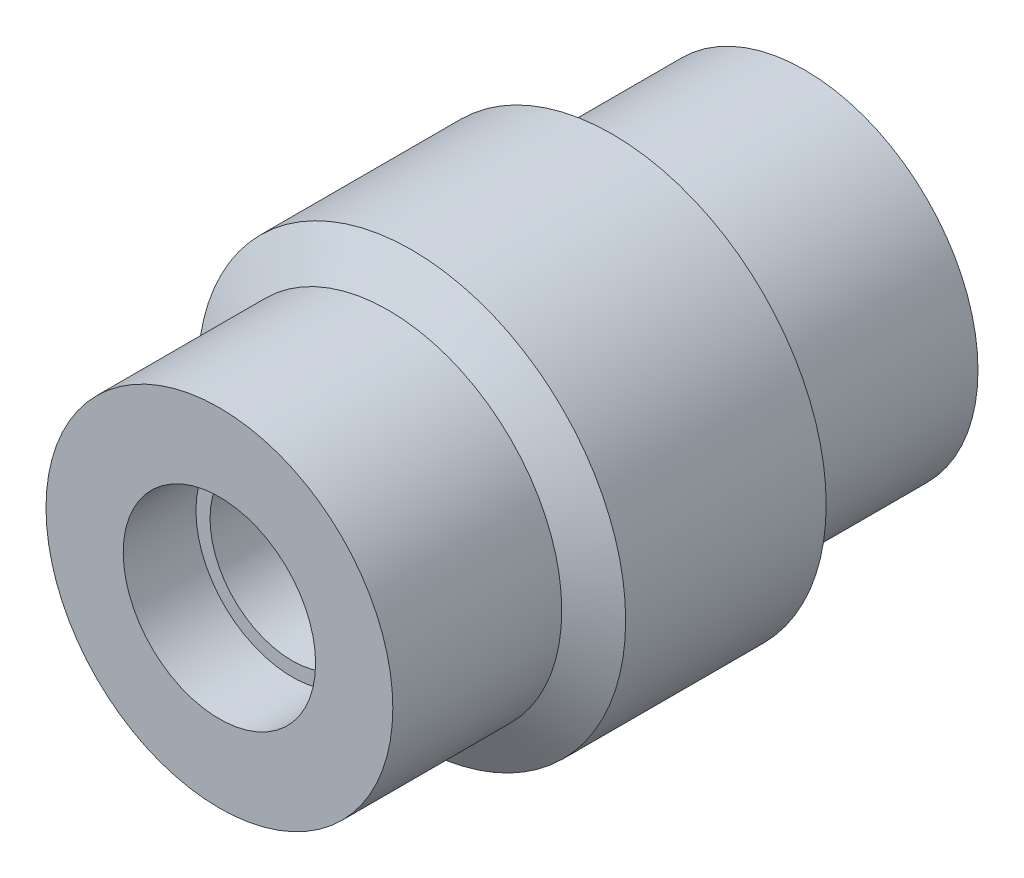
ISO-10303-21;
HEADER;
FILE_DESCRIPTION(('STEP AP214'),'2;1');
FILE_NAME('part.step','',(''),(''),'','','');
FILE_SCHEMA(('AUTOMOTIVE_DESIGN { 1 0 10303 214 1 1 1 1 }'));
ENDSEC;
DATA;
#1=APPLICATION_CONTEXT('core data for automotive mechanical design processes');
#2=APPLICATION_PROTOCOL_DEFINITION('international standard','automotive_design',2000,#1);
#3=PRODUCT_CONTEXT('',#1,'mechanical');
#4=PRODUCT('Part','Part','',(#3));
#5=PRODUCT_RELATED_PRODUCT_CATEGORY('part','',(#4));
#6=PRODUCT_DEFINITION_FORMATION('','',#4);
#7=PRODUCT_DEFINITION_CONTEXT('part definition',#1,'design');
#8=PRODUCT_DEFINITION('design','',#6,#7);
#9=PRODUCT_DEFINITION_SHAPE('','',#8);
#10=(LENGTH_UNIT() NAMED_UNIT(*) SI_UNIT(.MILLI.,.METRE.));
#11=(NAMED_UNIT(*) PLANE_ANGLE_UNIT() SI_UNIT($,.RADIAN.));
#12=(NAMED_UNIT(*) SI_UNIT($,.STERADIAN.) SOLID_ANGLE_UNIT());
#13=UNCERTAINTY_MEASURE_WITH_UNIT(LENGTH_MEASURE(1.E-05),#10,'distance_accuracy_value','');
#14=(GEOMETRIC_REPRESENTATION_CONTEXT(3) GLOBAL_UNCERTAINTY_ASSIGNED_CONTEXT((#13)) GLOBAL_UNIT_ASSIGNED_CONTEXT((#10,
#11,#12)) REPRESENTATION_CONTEXT('',''));
#15=CARTESIAN_POINT('',(0.,0.,0.));
#16=DIRECTION('',(0.,0.,1.));
#17=DIRECTION('',(1.,0.,0.));
#18=AXIS2_PLACEMENT_3D('',#15,#16,#17);
#19=CARTESIAN_POINT('',(0.,0.,24.9428));
#20=DIRECTION('',(0.,0.,-1.));
#21=DIRECTION('',(-1.,0.,0.));
#22=AXIS2_PLACEMENT_3D('',#19,#20,#21);
#23=CYLINDRICAL_SURFACE('',#22,3.5);
#24=CARTESIAN_POINT('',(0.,0.,21.8428));
#25=DIRECTION('',(0.,0.,1.));
#26=DIRECTION('',(1.,0.,0.));
#27=AXIS2_PLACEMENT_3D('',#24,#25,#26);
#28=CIRCLE('',#27,3.5);
#29=CARTESIAN_POINT('',(3.5,0.,21.8428));
#30=VERTEX_POINT('',#29);
#31=EDGE_CURVE('E48',#30,#30,#28,.T.);
#32=ORIENTED_EDGE('',*,*,#31,.T.);
#33=EDGE_LOOP('',(#32));
#34=FACE_BOUND('',#33,.T.);
#35=CARTESIAN_POINT('',(0.,0.,3.1));
#36=DIRECTION('',(0.,0.,-1.));
#37=DIRECTION('',(-1.,0.,0.));
#38=AXIS2_PLACEMENT_3D('',#35,#36,#37);
#39=CIRCLE('',#38,3.5);
#40=CARTESIAN_POINT('',(-3.5,0.,3.1));
#41=VERTEX_POINT('',#40);
#42=EDGE_CURVE('E35',#41,#41,#39,.T.);
#43=ORIENTED_EDGE('',*,*,#42,.T.);
#44=EDGE_LOOP('',(#43));
#45=FACE_BOUND('',#44,.T.);
#46=ADVANCED_FACE('F31',(#34,#45),#23,.F.);
#47=CARTESIAN_POINT('',(0.,0.,0.));
#48=DIRECTION('',(0.,0.,1.));
#49=DIRECTION('',(1.,0.,0.));
#50=AXIS2_PLACEMENT_3D('',#47,#48,#49);
#51=PLANE('',#50);
#52=CARTESIAN_POINT('',(0.,0.,0.));
#53=DIRECTION('',(0.,0.,1.));
#54=DIRECTION('',(1.,0.,0.));
#55=AXIS2_PLACEMENT_3D('',#52,#53,#54);
#56=CIRCLE('',#55,7.3914);
#57=CARTESIAN_POINT('',(7.3914,0.,0.));
#58=VERTEX_POINT('',#57);
#59=EDGE_CURVE('E39',#58,#58,#56,.T.);
#60=ORIENTED_EDGE('',*,*,#59,.F.);
#61=EDGE_LOOP('',(#60));
#62=FACE_BOUND('',#61,.T.);
#63=CARTESIAN_POINT('',(0.,0.,0.));
#64=DIRECTION('',(0.,0.,1.));
#65=DIRECTION('',(1.,0.,0.));
#66=AXIS2_PLACEMENT_3D('',#63,#64,#65);
#67=CIRCLE('',#66,4.1);
#68=CARTESIAN_POINT('',(-4.1,0.,0.));
#69=VERTEX_POINT('',#68);
#70=EDGE_CURVE('E65',#69,#69,#67,.T.);
#71=ORIENTED_EDGE('',*,*,#70,.T.);
#72=EDGE_LOOP('',(#71));
#73=FACE_BOUND('',#72,.T.);
#74=ADVANCED_FACE('F92',(#62,#73),#51,.F.);
#75=CARTESIAN_POINT('',(0.,0.,24.9428));
#76=DIRECTION('',(0.,0.,-1.));
#77=DIRECTION('',(-1.,0.,0.));
#78=AXIS2_PLACEMENT_3D('',#75,#76,#77);
#79=CYLINDRICAL_SURFACE('',#78,7.3914);
#80=CARTESIAN_POINT('',(0.,0.,7.2009));
#81=DIRECTION('',(0.,0.,-1.));
#82=DIRECTION('',(-1.,0.,0.));
#83=AXIS2_PLACEMENT_3D('',#80,#81,#82);
#84=CIRCLE('',#83,7.3914);
#85=CARTESIAN_POINT('',(-7.3914,0.,7.2009));
#86=VERTEX_POINT('',#85);
#87=EDGE_CURVE('E50',#86,#86,#84,.T.);
#88=ORIENTED_EDGE('',*,*,#87,.T.);
#89=EDGE_LOOP('',(#88));
#90=FACE_BOUND('',#89,.T.);
#91=ORIENTED_EDGE('',*,*,#59,.T.);
#92=EDGE_LOOP('',(#91));
#93=FACE_BOUND('',#92,.T.);
#94=ADVANCED_FACE('F97',(#90,#93),#79,.T.);
#95=CARTESIAN_POINT('',(0.,0.,24.9428));
#96=DIRECTION('',(0.,0.,1.));
#97=DIRECTION('',(1.,0.,0.));
#98=AXIS2_PLACEMENT_3D('',#95,#96,#97);
#99=PLANE('',#98);
#100=CARTESIAN_POINT('',(0.,0.,24.9428));
#101=DIRECTION('',(0.,0.,1.));
#102=DIRECTION('',(1.,0.,0.));
#103=AXIS2_PLACEMENT_3D('',#100,#101,#102);
#104=CIRCLE('',#103,4.1);
#105=CARTESIAN_POINT('',(4.1,0.,24.9428));
#106=VERTEX_POINT('',#105);
#107=EDGE_CURVE('E58',#106,#106,#104,.T.);
#108=ORIENTED_EDGE('',*,*,#107,.F.);
#109=EDGE_LOOP('',(#108));
#110=FACE_BOUND('',#109,.T.);
#111=CARTESIAN_POINT('',(0.,0.,24.9428));
#112=DIRECTION('',(0.,0.,1.));
#113=DIRECTION('',(1.,0.,0.));
#114=AXIS2_PLACEMENT_3D('',#111,#112,#113);
#115=CIRCLE('',#114,7.3914);
#116=CARTESIAN_POINT('',(7.3914,0.,24.9428));
#117=VERTEX_POINT('',#116);
#118=EDGE_CURVE('E10',#117,#117,#115,.T.);
#119=ORIENTED_EDGE('',*,*,#118,.T.);
#120=EDGE_LOOP('',(#119));
#121=FACE_BOUND('',#120,.T.);
#122=ADVANCED_FACE('F101',(#110,#121),#99,.T.);
#123=CARTESIAN_POINT('',(0.,0.,17.7419));
#124=DIRECTION('',(0.,0.,-1.));
#125=DIRECTION('',(-1.,0.,0.));
#126=AXIS2_PLACEMENT_3D('',#123,#124,#125);
#127=CIRCLE('',#126,7.3914);
#128=CARTESIAN_POINT('',(-7.3914,0.,17.7419));
#129=VERTEX_POINT('',#128);
#130=EDGE_CURVE('E55',#129,#129,#127,.T.);
#131=ORIENTED_EDGE('',*,*,#130,.F.);
#132=EDGE_LOOP('',(#131));
#133=FACE_BOUND('',#132,.T.);
#134=ORIENTED_EDGE('',*,*,#118,.F.);
#135=EDGE_LOOP('',(#134));
#136=FACE_BOUND('',#135,.T.);
#137=ADVANCED_FACE('F33',(#133,#136),#79,.T.);
#138=CARTESIAN_POINT('',(0.,0.,7.2009));
#139=DIRECTION('',(0.,0.,1.));
#140=DIRECTION('',(1.,0.,0.));
#141=AXIS2_PLACEMENT_3D('',#138,#139,#140);
#142=CONICAL_SURFACE('',#141,7.3914,1.0471975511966);
#143=CARTESIAN_POINT('',(0.,0.,8.19809938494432));
#144=DIRECTION('',(0.,0.,-1.));
#145=DIRECTION('',(-1.,0.,0.));
#146=AXIS2_PLACEMENT_3D('',#143,#144,#145);
#147=CIRCLE('',#146,9.1186);
#148=CARTESIAN_POINT('',(-9.1186,0.,8.19809938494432));
#149=VERTEX_POINT('',#148);
#150=EDGE_CURVE('E44',#149,#149,#147,.T.);
#151=ORIENTED_EDGE('',*,*,#150,.T.);
#152=EDGE_LOOP('',(#151));
#153=FACE_BOUND('',#152,.T.);
#154=ORIENTED_EDGE('',*,*,#87,.F.);
#155=EDGE_LOOP('',(#154));
#156=FACE_BOUND('',#155,.T.);
#157=ADVANCED_FACE('F76',(#153,#156),#142,.T.);
#158=CARTESIAN_POINT('',(0.,0.,0.));
#159=DIRECTION('',(0.,0.,-1.));
#160=DIRECTION('',(-1.,0.,0.));
#161=AXIS2_PLACEMENT_3D('',#158,#159,#160);
#162=CYLINDRICAL_SURFACE('',#161,9.1186);
#163=CARTESIAN_POINT('',(0.,0.,16.7447006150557));
#164=DIRECTION('',(0.,0.,-1.));
#165=DIRECTION('',(-1.,0.,0.));
#166=AXIS2_PLACEMENT_3D('',#163,#164,#165);
#167=CIRCLE('',#166,9.1186);
#168=CARTESIAN_POINT('',(-9.1186,0.,16.7447006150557));
#169=VERTEX_POINT('',#168);
#170=EDGE_CURVE('E69',#169,#169,#167,.T.);
#171=ORIENTED_EDGE('',*,*,#170,.T.);
#172=EDGE_LOOP('',(#171));
#173=FACE_BOUND('',#172,.T.);
#174=ORIENTED_EDGE('',*,*,#150,.F.);
#175=EDGE_LOOP('',(#174));
#176=FACE_BOUND('',#175,.T.);
#177=ADVANCED_FACE('F79',(#173,#176),#162,.T.);
#178=CARTESIAN_POINT('',(0.,0.,16.7447006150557));
#179=DIRECTION('',(0.,0.,-1.));
#180=DIRECTION('',(-1.,0.,0.));
#181=AXIS2_PLACEMENT_3D('',#178,#179,#180);
#182=CONICAL_SURFACE('',#181,9.1186,1.0471975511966);
#183=ORIENTED_EDGE('',*,*,#130,.T.);
#184=EDGE_LOOP('',(#183));
#185=FACE_BOUND('',#184,.T.);
#186=ORIENTED_EDGE('',*,*,#170,.F.);
#187=EDGE_LOOP('',(#186));
#188=FACE_BOUND('',#187,.T.);
#189=ADVANCED_FACE('F81',(#185,#188),#182,.T.);
#190=CARTESIAN_POINT('',(0.,0.,21.8428));
#191=DIRECTION('',(0.,0.,1.));
#192=DIRECTION('',(1.,0.,0.));
#193=AXIS2_PLACEMENT_3D('',#190,#191,#192);
#194=CYLINDRICAL_SURFACE('',#193,4.1);
#195=CARTESIAN_POINT('',(0.,0.,21.8428));
#196=DIRECTION('',(0.,0.,1.));
#197=DIRECTION('',(1.,0.,0.));
#198=AXIS2_PLACEMENT_3D('',#195,#196,#197);
#199=CIRCLE('',#198,4.1);
#200=CARTESIAN_POINT('',(4.1,0.,21.8428));
#201=VERTEX_POINT('',#200);
#202=EDGE_CURVE('E51',#201,#201,#199,.T.);
#203=CARTESIAN_POINT('',(4.1,0.,21.8428));
#204=CARTESIAN_POINT('',(4.1,0.,21.8750916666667));
#205=CARTESIAN_POINT('',(4.1,0.,21.9073833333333));
#206=CARTESIAN_POINT('',(4.1,0.,21.9719666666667));
#207=CARTESIAN_POINT('',(4.1,0.,22.0042583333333));
#208=CARTESIAN_POINT('',(4.1,0.,22.0688416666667));
#209=CARTESIAN_POINT('',(4.1,0.,22.1011333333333));
#210=CARTESIAN_POINT('',(4.1,0.,22.1657166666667));
#211=CARTESIAN_POINT('',(4.1,0.,22.1980083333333));
#212=CARTESIAN_POINT('',(4.1,0.,22.2625916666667));
#213=CARTESIAN_POINT('',(4.1,0.,22.2948833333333));
#214=CARTESIAN_POINT('',(4.1,0.,22.3594666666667));
#215=CARTESIAN_POINT('',(4.1,0.,22.3917583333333));
#216=CARTESIAN_POINT('',(4.1,0.,22.4563416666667));
#217=CARTESIAN_POINT('',(4.1,0.,22.4886333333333));
#218=CARTESIAN_POINT('',(4.1,0.,22.5532166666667));
#219=CARTESIAN_POINT('',(4.1,0.,22.5855083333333));
#220=CARTESIAN_POINT('',(4.1,0.,22.6500916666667));
#221=CARTESIAN_POINT('',(4.1,0.,22.6823833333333));
#222=CARTESIAN_POINT('',(4.1,0.,22.7469666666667));
#223=CARTESIAN_POINT('',(4.1,0.,22.7792583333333));
#224=CARTESIAN_POINT('',(4.1,0.,22.8438416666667));
#225=CARTESIAN_POINT('',(4.1,0.,22.8761333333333));
#226=CARTESIAN_POINT('',(4.1,0.,22.9407166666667));
#227=CARTESIAN_POINT('',(4.1,0.,22.9730083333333));
#228=CARTESIAN_POINT('',(4.1,0.,23.0375916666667));
#229=CARTESIAN_POINT('',(4.1,0.,23.0698833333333));
#230=CARTESIAN_POINT('',(4.1,0.,23.1344666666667));
#231=CARTESIAN_POINT('',(4.1,0.,23.1667583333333));
#232=CARTESIAN_POINT('',(4.1,0.,23.2313416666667));
#233=CARTESIAN_POINT('',(4.1,0.,23.2636333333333));
#234=CARTESIAN_POINT('',(4.1,0.,23.3282166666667));
#235=CARTESIAN_POINT('',(4.1,0.,23.3605083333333));
#236=CARTESIAN_POINT('',(4.1,0.,23.4250916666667));
#237=CARTESIAN_POINT('',(4.1,0.,23.4573833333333));
#238=CARTESIAN_POINT('',(4.1,0.,23.5219666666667));
#239=CARTESIAN_POINT('',(4.1,0.,23.5542583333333));
#240=CARTESIAN_POINT('',(4.1,0.,23.6188416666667));
#241=CARTESIAN_POINT('',(4.1,0.,23.6511333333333));
#242=CARTESIAN_POINT('',(4.1,0.,23.7157166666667));
#243=CARTESIAN_POINT('',(4.1,0.,23.7480083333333));
#244=CARTESIAN_POINT('',(4.1,0.,23.8125916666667));
#245=CARTESIAN_POINT('',(4.1,0.,23.8448833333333));
#246=CARTESIAN_POINT('',(4.1,0.,23.9094666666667));
#247=CARTESIAN_POINT('',(4.1,0.,23.9417583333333));
#248=CARTESIAN_POINT('',(4.1,0.,24.0063416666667));
#249=CARTESIAN_POINT('',(4.1,0.,24.0386333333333));
#250=CARTESIAN_POINT('',(4.1,0.,24.1032166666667));
#251=CARTESIAN_POINT('',(4.1,0.,24.1355083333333));
#252=CARTESIAN_POINT('',(4.1,0.,24.2000916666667));
#253=CARTESIAN_POINT('',(4.1,0.,24.2323833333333));
#254=CARTESIAN_POINT('',(4.1,0.,24.2969666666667));
#255=CARTESIAN_POINT('',(4.1,0.,24.3292583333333));
#256=CARTESIAN_POINT('',(4.1,0.,24.3938416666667));
#257=CARTESIAN_POINT('',(4.1,0.,24.4261333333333));
#258=CARTESIAN_POINT('',(4.1,0.,24.4907166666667));
#259=CARTESIAN_POINT('',(4.1,0.,24.5230083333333));
#260=CARTESIAN_POINT('',(4.1,0.,24.5875916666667));
#261=CARTESIAN_POINT('',(4.1,0.,24.6198833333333));
#262=CARTESIAN_POINT('',(4.1,0.,24.6844666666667));
#263=CARTESIAN_POINT('',(4.1,0.,24.7167583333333));
#264=CARTESIAN_POINT('',(4.1,0.,24.7813416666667));
#265=CARTESIAN_POINT('',(4.1,0.,24.8136333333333));
#266=CARTESIAN_POINT('',(4.1,0.,24.8782166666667));
#267=CARTESIAN_POINT('',(4.1,0.,24.9105083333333));
#268=CARTESIAN_POINT('',(4.1,0.,24.9428));
#269=B_SPLINE_CURVE_WITH_KNOTS('',3,(#203,#204,#205,#206,#207,#208,#209,#210,#211,#212,#213,
#214,#215,#216,#217,#218,#219,#220,#221,#222,#223,#224,#225,#226,#227,#228,#229,#230,#231,#232,
#233,#234,#235,#236,#237,#238,#239,#240,#241,#242,#243,#244,#245,#246,#247,#248,#249,#250,#251,
#252,#253,#254,#255,#256,#257,#258,#259,#260,#261,#262,#263,#264,#265,#266,#267,#268),
.UNSPECIFIED.,.F.,.F.,(4,2,2,2,2,2,2,2,2,2,2,2,2,2,2,2,2,2,2,2,2,2,2,2,2,2,2,2,2,2,2,2,4),(0.,
0.0968750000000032,0.193750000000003,0.290625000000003,0.387500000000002,0.484375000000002,
0.581250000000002,0.678125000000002,0.775000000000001,0.871875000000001,0.968750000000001,
1.065625,1.1625,1.259375,1.35625,1.453125,1.55,1.646875,1.74375,1.840625,1.9375,2.034375,
2.13125,2.228125,2.325,2.421875,2.51875,2.615625,2.7125,2.809375,2.90625,3.003125,3.1),.UNSPECIFIED.);
#270=EDGE_CURVE('BSEAM87',#201,#106,#269,.T.);
#271=ORIENTED_EDGE('',*,*,#202,.F.);
#272=ORIENTED_EDGE('',*,*,#107,.T.);
#273=ORIENTED_EDGE('',*,*,#270,.T.);
#274=ORIENTED_EDGE('',*,*,#270,.F.);
#275=EDGE_LOOP('',(#271,#273,#272,#274));
#276=FACE_BOUND('',#275,.T.);
#277=ADVANCED_FACE('F87',(#276),#194,.F.);
#278=CARTESIAN_POINT('',(0.,0.,21.8428));
#279=DIRECTION('',(0.,0.,1.));
#280=DIRECTION('',(1.,0.,0.));
#281=AXIS2_PLACEMENT_3D('',#278,#279,#280);
#282=PLANE('',#281);
#283=ORIENTED_EDGE('',*,*,#31,.F.);
#284=EDGE_LOOP('',(#283));
#285=FACE_BOUND('',#284,.T.);
#286=ORIENTED_EDGE('',*,*,#202,.T.);
#287=EDGE_LOOP('',(#286));
#288=FACE_BOUND('',#287,.T.);
#289=ADVANCED_FACE('F113',(#285,#288),#282,.T.);
#290=CARTESIAN_POINT('',(0.,0.,3.1));
#291=DIRECTION('',(0.,0.,-1.));
#292=DIRECTION('',(-1.,0.,0.));
#293=AXIS2_PLACEMENT_3D('',#290,#291,#292);
#294=CYLINDRICAL_SURFACE('',#293,4.1);
#295=CARTESIAN_POINT('',(0.,0.,3.1));
#296=DIRECTION('',(0.,0.,1.));
#297=DIRECTION('',(1.,0.,0.));
#298=AXIS2_PLACEMENT_3D('',#295,#296,#297);
#299=CIRCLE('',#298,4.1);
#300=CARTESIAN_POINT('',(-4.1,0.,3.1));
#301=VERTEX_POINT('',#300);
#302=EDGE_CURVE('E136',#301,#301,#299,.T.);
#303=CARTESIAN_POINT('',(-4.1,0.,3.1));
#304=CARTESIAN_POINT('',(-4.1,0.,3.06770833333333));
#305=CARTESIAN_POINT('',(-4.1,0.,3.03541666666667));
#306=CARTESIAN_POINT('',(-4.1,0.,2.97083333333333));
#307=CARTESIAN_POINT('',(-4.1,0.,2.93854166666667));
#308=CARTESIAN_POINT('',(-4.1,0.,2.87395833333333));
#309=CARTESIAN_POINT('',(-4.1,0.,2.84166666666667));
#310=CARTESIAN_POINT('',(-4.1,0.,2.77708333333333));
#311=CARTESIAN_POINT('',(-4.1,0.,2.74479166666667));
#312=CARTESIAN_POINT('',(-4.1,0.,2.68020833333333));
#313=CARTESIAN_POINT('',(-4.1,0.,2.64791666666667));
#314=CARTESIAN_POINT('',(-4.1,0.,2.58333333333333));
#315=CARTESIAN_POINT('',(-4.1,0.,2.55104166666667));
#316=CARTESIAN_POINT('',(-4.1,0.,2.48645833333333));
#317=CARTESIAN_POINT('',(-4.1,0.,2.45416666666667));
#318=CARTESIAN_POINT('',(-4.1,0.,2.38958333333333));
#319=CARTESIAN_POINT('',(-4.1,0.,2.35729166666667));
#320=CARTESIAN_POINT('',(-4.1,0.,2.29270833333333));
#321=CARTESIAN_POINT('',(-4.1,0.,2.26041666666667));
#322=CARTESIAN_POINT('',(-4.1,0.,2.19583333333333));
#323=CARTESIAN_POINT('',(-4.1,0.,2.16354166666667));
#324=CARTESIAN_POINT('',(-4.1,0.,2.09895833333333));
#325=CARTESIAN_POINT('',(-4.1,0.,2.06666666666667));
#326=CARTESIAN_POINT('',(-4.1,0.,2.00208333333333));
#327=CARTESIAN_POINT('',(-4.1,0.,1.96979166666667));
#328=CARTESIAN_POINT('',(-4.1,0.,1.90520833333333));
#329=CARTESIAN_POINT('',(-4.1,0.,1.87291666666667));
#330=CARTESIAN_POINT('',(-4.1,0.,1.80833333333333));
#331=CARTESIAN_POINT('',(-4.1,0.,1.77604166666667));
#332=CARTESIAN_POINT('',(-4.1,0.,1.71145833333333));
#333=CARTESIAN_POINT('',(-4.1,0.,1.67916666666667));
#334=CARTESIAN_POINT('',(-4.1,0.,1.61458333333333));
#335=CARTESIAN_POINT('',(-4.1,0.,1.58229166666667));
#336=CARTESIAN_POINT('',(-4.1,0.,1.51770833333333));
#337=CARTESIAN_POINT('',(-4.1,0.,1.48541666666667));
#338=CARTESIAN_POINT('',(-4.1,0.,1.42083333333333));
#339=CARTESIAN_POINT('',(-4.1,0.,1.38854166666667));
#340=CARTESIAN_POINT('',(-4.1,0.,1.32395833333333));
#341=CARTESIAN_POINT('',(-4.1,0.,1.29166666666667));
#342=CARTESIAN_POINT('',(-4.1,0.,1.22708333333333));
#343=CARTESIAN_POINT('',(-4.1,0.,1.19479166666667));
#344=CARTESIAN_POINT('',(-4.1,0.,1.13020833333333));
#345=CARTESIAN_POINT('',(-4.1,0.,1.09791666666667));
#346=CARTESIAN_POINT('',(-4.1,0.,1.03333333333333));
#347=CARTESIAN_POINT('',(-4.1,0.,1.00104166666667));
#348=CARTESIAN_POINT('',(-4.1,0.,0.936458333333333));
#349=CARTESIAN_POINT('',(-4.1,0.,0.904166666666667));
#350=CARTESIAN_POINT('',(-4.1,0.,0.839583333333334));
#351=CARTESIAN_POINT('',(-4.1,0.,0.807291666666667));
#352=CARTESIAN_POINT('',(-4.1,0.,0.742708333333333));
#353=CARTESIAN_POINT('',(-4.1,0.,0.710416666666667));
#354=CARTESIAN_POINT('',(-4.1,0.,0.645833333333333));
#355=CARTESIAN_POINT('',(-4.1,0.,0.613541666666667));
#356=CARTESIAN_POINT('',(-4.1,0.,0.548958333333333));
#357=CARTESIAN_POINT('',(-4.1,0.,0.516666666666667));
#358=CARTESIAN_POINT('',(-4.1,0.,0.452083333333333));
#359=CARTESIAN_POINT('',(-4.1,0.,0.419791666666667));
#360=CARTESIAN_POINT('',(-4.1,0.,0.355208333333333));
#361=CARTESIAN_POINT('',(-4.1,0.,0.322916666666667));
#362=CARTESIAN_POINT('',(-4.1,0.,0.258333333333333));
#363=CARTESIAN_POINT('',(-4.1,0.,0.226041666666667));
#364=CARTESIAN_POINT('',(-4.1,0.,0.161458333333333));
#365=CARTESIAN_POINT('',(-4.1,0.,0.129166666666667));
#366=CARTESIAN_POINT('',(-4.1,0.,0.0645833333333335));
#367=CARTESIAN_POINT('',(-4.1,0.,0.0322916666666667));
#368=CARTESIAN_POINT('',(-4.1,0.,0.));
#369=B_SPLINE_CURVE_WITH_KNOTS('',3,(#303,#304,#305,#306,#307,#308,#309,#310,#311,#312,#313,
#314,#315,#316,#317,#318,#319,#320,#321,#322,#323,#324,#325,#326,#327,#328,#329,#330,#331,#332,
#333,#334,#335,#336,#337,#338,#339,#340,#341,#342,#343,#344,#345,#346,#347,#348,#349,#350,#351,
#352,#353,#354,#355,#356,#357,#358,#359,#360,#361,#362,#363,#364,#365,#366,#367,#368),
.UNSPECIFIED.,.F.,.F.,(4,2,2,2,2,2,2,2,2,2,2,2,2,2,2,2,2,2,2,2,2,2,2,2,2,2,2,2,2,2,2,2,4),(0.,
0.0968750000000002,0.19375,0.290625,0.3875,0.484375,0.58125,0.678125,0.775,0.871875,0.96875,
1.065625,1.1625,1.259375,1.35625,1.453125,1.55,1.646875,1.74375,1.840625,1.9375,2.034375,
2.13125,2.228125,2.325,2.421875,2.51875,2.615625,2.7125,2.809375,2.90625,3.003125,3.1),.UNSPECIFIED.);
#370=EDGE_CURVE('BSEAM119',#301,#69,#369,.T.);
#371=ORIENTED_EDGE('',*,*,#302,.T.);
#372=ORIENTED_EDGE('',*,*,#70,.F.);
#373=ORIENTED_EDGE('',*,*,#370,.T.);
#374=ORIENTED_EDGE('',*,*,#370,.F.);
#375=EDGE_LOOP('',(#371,#373,#372,#374));
#376=FACE_BOUND('',#375,.T.);
#377=ADVANCED_FACE('F119',(#376),#294,.F.);
#378=CARTESIAN_POINT('',(0.,0.,3.1));
#379=DIRECTION('',(0.,0.,-1.));
#380=DIRECTION('',(1.,0.,0.));
#381=AXIS2_PLACEMENT_3D('',#378,#379,#380);
#382=PLANE('',#381);
#383=ORIENTED_EDGE('',*,*,#42,.F.);
#384=EDGE_LOOP('',(#383));
#385=FACE_BOUND('',#384,.T.);
#386=ORIENTED_EDGE('',*,*,#302,.F.);
#387=EDGE_LOOP('',(#386));
#388=FACE_BOUND('',#387,.T.);
#389=ADVANCED_FACE('F125',(#385,#388),#382,.T.);
#390=CLOSED_SHELL('',(#46,#74,#94,#122,#137,#157,#177,#189,#277,#289,#377,#389));
#391=MANIFOLD_SOLID_BREP('B2',#390);
#392=ADVANCED_BREP_SHAPE_REPRESENTATION('',(#18,#391),#14);
#393=SHAPE_DEFINITION_REPRESENTATION(#9,#392);
ENDSEC;
END-ISO-10303-21;
